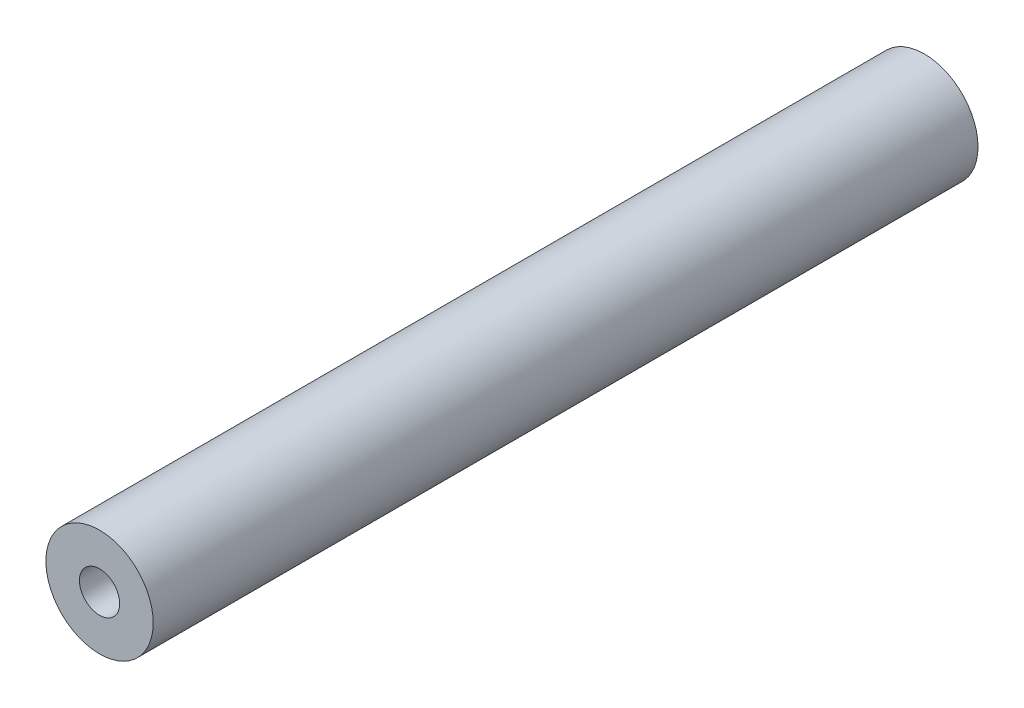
from build123d import *

# Parameters (mm, degrees)
SKETCH_1_R          = 8
EXTRUDE_1_DEPTH     = 123
SKETCH_2_R          = 3
CUT_EXTRUDE_1_DEPTH = 15
CUT_EXTRUDE_START   = -15
SKETCH_3_R          = 3
CUT_EXTRUDE_2_DEPTH = 15


with BuildPart() as part:
    # Sketch 1 → Extrude 1 (new body)
    with BuildSketch(Plane.XY):
        Circle(SKETCH_1_R)
    extrude(amount=EXTRUDE_1_DEPTH)

    # Sketch 2 → Cut-Extrude 1 (cut)
    with BuildSketch(Plane.XY.offset(123)):
        Circle(SKETCH_2_R)
    extrude(amount=-CUT_EXTRUDE_1_DEPTH, mode=Mode.SUBTRACT)

    # Sketch 3 → Cut-Extrude 2 (cut)
    with BuildSketch(Plane(origin=(0, 0, 0), x_dir=(-1, 0, 0), z_dir=(0, 0, -1)).offset(CUT_EXTRUDE_START)):
        with Locations(Location((0, 0, 0), (0, 0, 180))):
            Circle(SKETCH_3_R)
    extrude(amount=CUT_EXTRUDE_2_DEPTH, mode=Mode.SUBTRACT)


solid = part.part
